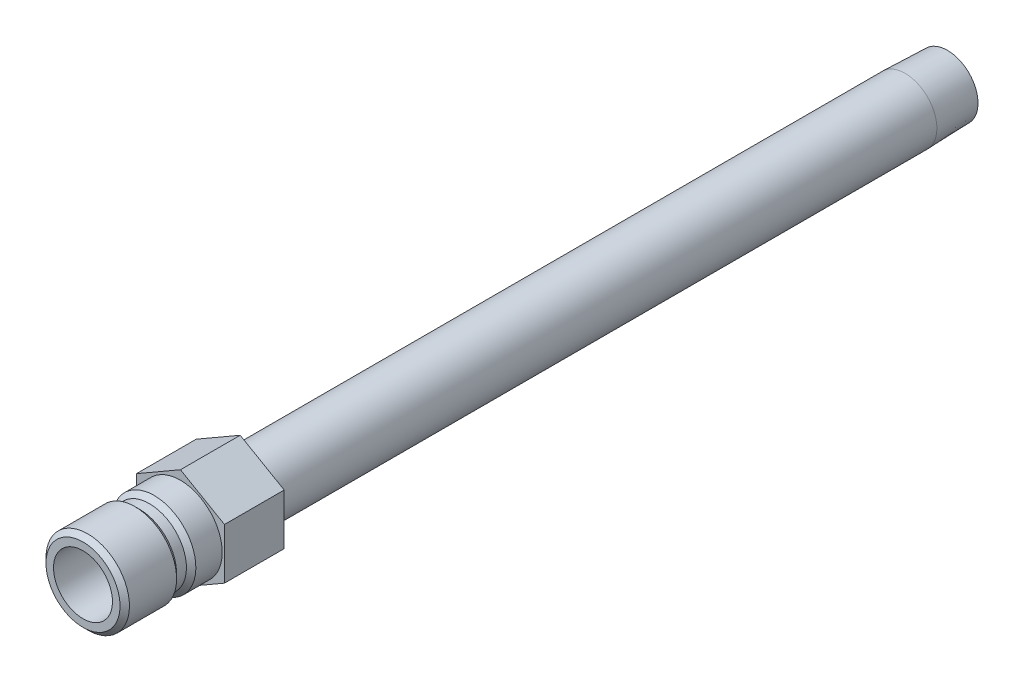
ISO-10303-21;
HEADER;
FILE_DESCRIPTION(('STEP AP214'),'2;1');
FILE_NAME('part.step','',(''),(''),'','','');
FILE_SCHEMA(('AUTOMOTIVE_DESIGN { 1 0 10303 214 1 1 1 1 }'));
ENDSEC;
DATA;
#1=APPLICATION_CONTEXT('core data for automotive mechanical design processes');
#2=APPLICATION_PROTOCOL_DEFINITION('international standard','automotive_design',2000,#1);
#3=PRODUCT_CONTEXT('',#1,'mechanical');
#4=PRODUCT('Part','Part','',(#3));
#5=PRODUCT_RELATED_PRODUCT_CATEGORY('part','',(#4));
#6=PRODUCT_DEFINITION_FORMATION('','',#4);
#7=PRODUCT_DEFINITION_CONTEXT('part definition',#1,'design');
#8=PRODUCT_DEFINITION('design','',#6,#7);
#9=PRODUCT_DEFINITION_SHAPE('','',#8);
#10=(LENGTH_UNIT() NAMED_UNIT(*) SI_UNIT(.MILLI.,.METRE.));
#11=(NAMED_UNIT(*) PLANE_ANGLE_UNIT() SI_UNIT($,.RADIAN.));
#12=(NAMED_UNIT(*) SI_UNIT($,.STERADIAN.) SOLID_ANGLE_UNIT());
#13=UNCERTAINTY_MEASURE_WITH_UNIT(LENGTH_MEASURE(1.E-05),#10,'distance_accuracy_value','');
#14=(GEOMETRIC_REPRESENTATION_CONTEXT(3) GLOBAL_UNCERTAINTY_ASSIGNED_CONTEXT((#13)) GLOBAL_UNIT_ASSIGNED_CONTEXT((#10,
#11,#12)) REPRESENTATION_CONTEXT('',''));
#15=CARTESIAN_POINT('',(0.,0.,0.));
#16=DIRECTION('',(0.,0.,1.));
#17=DIRECTION('',(1.,0.,0.));
#18=AXIS2_PLACEMENT_3D('',#15,#16,#17);
#19=CARTESIAN_POINT('',(0.,0.,-9.652));
#20=DIRECTION('',(0.,0.,-1.));
#21=DIRECTION('',(0.,1.,0.));
#22=AXIS2_PLACEMENT_3D('',#19,#20,#21);
#23=CYLINDRICAL_SURFACE('',#22,4.7625);
#24=CARTESIAN_POINT('',(0.,0.,3.556));
#25=DIRECTION('',(0.,0.,-1.));
#26=DIRECTION('',(0.,1.,0.));
#27=AXIS2_PLACEMENT_3D('',#24,#25,#26);
#28=CIRCLE('',#27,4.7625);
#29=CARTESIAN_POINT('',(0.,4.7625,3.556));
#30=VERTEX_POINT('',#29);
#31=EDGE_CURVE('E137',#30,#30,#28,.T.);
#32=ORIENTED_EDGE('',*,*,#31,.T.);
#33=EDGE_LOOP('',(#32));
#34=FACE_BOUND('',#33,.T.);
#35=CARTESIAN_POINT('',(0.,0.,15.748));
#36=DIRECTION('',(0.,0.,-1.));
#37=DIRECTION('',(0.,1.,0.));
#38=AXIS2_PLACEMENT_3D('',#35,#36,#37);
#39=CIRCLE('',#38,4.7625);
#40=CARTESIAN_POINT('',(0.,4.7625,15.748));
#41=VERTEX_POINT('',#40);
#42=EDGE_CURVE('E41',#41,#41,#39,.T.);
#43=ORIENTED_EDGE('',*,*,#42,.F.);
#44=EDGE_LOOP('',(#43));
#45=FACE_BOUND('',#44,.T.);
#46=ADVANCED_FACE('F33',(#34,#45),#23,.F.);
#47=CARTESIAN_POINT('',(0.,4.7625,15.748));
#48=DIRECTION('',(0.,0.,1.));
#49=DIRECTION('',(0.,-1.,0.));
#50=AXIS2_PLACEMENT_3D('',#47,#48,#49);
#51=PLANE('',#50);
#52=ORIENTED_EDGE('',*,*,#42,.T.);
#53=EDGE_LOOP('',(#52));
#54=FACE_BOUND('',#53,.T.);
#55=CARTESIAN_POINT('',(0.,0.,15.748));
#56=DIRECTION('',(0.,0.,-1.));
#57=DIRECTION('',(0.,1.,0.));
#58=AXIS2_PLACEMENT_3D('',#55,#56,#57);
#59=CIRCLE('',#58,5.9817);
#60=CARTESIAN_POINT('',(0.,5.9817,15.748));
#61=VERTEX_POINT('',#60);
#62=EDGE_CURVE('E175',#61,#61,#59,.T.);
#63=ORIENTED_EDGE('',*,*,#62,.F.);
#64=EDGE_LOOP('',(#63));
#65=FACE_BOUND('',#64,.T.);
#66=ADVANCED_FACE('F180',(#54,#65),#51,.T.);
#67=CARTESIAN_POINT('',(0.,0.,14.986));
#68=DIRECTION('',(0.,0.,-1.));
#69=DIRECTION('',(0.,1.,0.));
#70=AXIS2_PLACEMENT_3D('',#67,#68,#69);
#71=CONICAL_SURFACE('',#70,6.7437,0.785398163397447);
#72=ORIENTED_EDGE('',*,*,#62,.T.);
#73=EDGE_LOOP('',(#72));
#74=FACE_BOUND('',#73,.T.);
#75=CARTESIAN_POINT('',(0.,0.,14.986));
#76=DIRECTION('',(0.,0.,-1.));
#77=DIRECTION('',(0.,1.,0.));
#78=AXIS2_PLACEMENT_3D('',#75,#76,#77);
#79=CIRCLE('',#78,6.7437);
#80=CARTESIAN_POINT('',(0.,6.7437,14.986));
#81=VERTEX_POINT('',#80);
#82=EDGE_CURVE('E172',#81,#81,#79,.T.);
#83=ORIENTED_EDGE('',*,*,#82,.F.);
#84=EDGE_LOOP('',(#83));
#85=FACE_BOUND('',#84,.T.);
#86=ADVANCED_FACE('F188',(#74,#85),#71,.T.);
#87=CARTESIAN_POINT('',(0.,0.,-9.652));
#88=DIRECTION('',(0.,0.,-1.));
#89=DIRECTION('',(0.,1.,0.));
#90=AXIS2_PLACEMENT_3D('',#87,#88,#89);
#91=CYLINDRICAL_SURFACE('',#90,6.7437);
#92=ORIENTED_EDGE('',*,*,#82,.T.);
#93=EDGE_LOOP('',(#92));
#94=FACE_BOUND('',#93,.T.);
#95=CARTESIAN_POINT('',(0.,0.,7.366));
#96=DIRECTION('',(0.,0.,-1.));
#97=DIRECTION('',(0.,1.,0.));
#98=AXIS2_PLACEMENT_3D('',#95,#96,#97);
#99=CIRCLE('',#98,6.7437);
#100=CARTESIAN_POINT('',(0.,6.7437,7.366));
#101=VERTEX_POINT('',#100);
#102=EDGE_CURVE('E169',#101,#101,#99,.T.);
#103=ORIENTED_EDGE('',*,*,#102,.F.);
#104=EDGE_LOOP('',(#103));
#105=FACE_BOUND('',#104,.T.);
#106=ADVANCED_FACE('F237',(#94,#105),#91,.T.);
#107=CARTESIAN_POINT('',(0.,0.,6.604));
#108=DIRECTION('',(0.,0.,1.));
#109=DIRECTION('',(0.,-1.,0.));
#110=AXIS2_PLACEMENT_3D('',#107,#108,#109);
#111=CONICAL_SURFACE('',#110,5.9817,0.785398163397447);
#112=ORIENTED_EDGE('',*,*,#102,.T.);
#113=EDGE_LOOP('',(#112));
#114=FACE_BOUND('',#113,.T.);
#115=CARTESIAN_POINT('',(0.,0.,6.604));
#116=DIRECTION('',(0.,0.,-1.));
#117=DIRECTION('',(0.,1.,0.));
#118=AXIS2_PLACEMENT_3D('',#115,#116,#117);
#119=CIRCLE('',#118,5.9817);
#120=CARTESIAN_POINT('',(0.,5.9817,6.604));
#121=VERTEX_POINT('',#120);
#122=EDGE_CURVE('E166',#121,#121,#119,.T.);
#123=ORIENTED_EDGE('',*,*,#122,.F.);
#124=EDGE_LOOP('',(#123));
#125=FACE_BOUND('',#124,.T.);
#126=ADVANCED_FACE('F233',(#114,#125),#111,.T.);
#127=CARTESIAN_POINT('',(0.,0.,-9.652));
#128=DIRECTION('',(0.,0.,-1.));
#129=DIRECTION('',(0.,1.,0.));
#130=AXIS2_PLACEMENT_3D('',#127,#128,#129);
#131=CYLINDRICAL_SURFACE('',#130,5.9817);
#132=ORIENTED_EDGE('',*,*,#122,.T.);
#133=EDGE_LOOP('',(#132));
#134=FACE_BOUND('',#133,.T.);
#135=CARTESIAN_POINT('',(0.,0.,5.0165));
#136=DIRECTION('',(0.,0.,-1.));
#137=DIRECTION('',(0.,1.,0.));
#138=AXIS2_PLACEMENT_3D('',#135,#136,#137);
#139=CIRCLE('',#138,5.9817);
#140=CARTESIAN_POINT('',(0.,5.9817,5.0165));
#141=VERTEX_POINT('',#140);
#142=EDGE_CURVE('E163',#141,#141,#139,.T.);
#143=ORIENTED_EDGE('',*,*,#142,.F.);
#144=EDGE_LOOP('',(#143));
#145=FACE_BOUND('',#144,.T.);
#146=ADVANCED_FACE('F229',(#134,#145),#131,.T.);
#147=CARTESIAN_POINT('',(0.,0.,4.2545));
#148=DIRECTION('',(0.,0.,-1.));
#149=DIRECTION('',(0.,1.,0.));
#150=AXIS2_PLACEMENT_3D('',#147,#148,#149);
#151=CONICAL_SURFACE('',#150,6.7437,0.785398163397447);
#152=ORIENTED_EDGE('',*,*,#142,.T.);
#153=EDGE_LOOP('',(#152));
#154=FACE_BOUND('',#153,.T.);
#155=CARTESIAN_POINT('',(0.,0.,4.2545));
#156=DIRECTION('',(0.,0.,-1.));
#157=DIRECTION('',(0.,1.,0.));
#158=AXIS2_PLACEMENT_3D('',#155,#156,#157);
#159=CIRCLE('',#158,6.7437);
#160=CARTESIAN_POINT('',(0.,6.7437,4.2545));
#161=VERTEX_POINT('',#160);
#162=EDGE_CURVE('E160',#161,#161,#159,.T.);
#163=ORIENTED_EDGE('',*,*,#162,.F.);
#164=EDGE_LOOP('',(#163));
#165=FACE_BOUND('',#164,.T.);
#166=ADVANCED_FACE('F225',(#154,#165),#151,.T.);
#167=CARTESIAN_POINT('',(0.,0.,-9.652));
#168=DIRECTION('',(0.,0.,-1.));
#169=DIRECTION('',(0.,1.,0.));
#170=AXIS2_PLACEMENT_3D('',#167,#168,#169);
#171=CYLINDRICAL_SURFACE('',#170,6.7437);
#172=CARTESIAN_POINT('',(0.,0.,0.));
#173=DIRECTION('',(0.,0.,1.));
#174=DIRECTION('',(1.,0.,0.));
#175=AXIS2_PLACEMENT_3D('',#172,#173,#174);
#176=CIRCLE('',#175,6.7437);
#177=CARTESIAN_POINT('',(6.7437,0.,0.));
#178=VERTEX_POINT('',#177);
#179=EDGE_CURVE('E11',#178,#178,#176,.F.);
#180=ORIENTED_EDGE('',*,*,#179,.F.);
#181=EDGE_LOOP('',(#180));
#182=FACE_BOUND('',#181,.T.);
#183=ORIENTED_EDGE('',*,*,#162,.T.);
#184=EDGE_LOOP('',(#183));
#185=FACE_BOUND('',#184,.T.);
#186=ADVANCED_FACE('F221',(#182,#185),#171,.T.);
#187=CARTESIAN_POINT('',(0.,6.7437,-9.652));
#188=DIRECTION('',(0.,0.,-1.));
#189=DIRECTION('',(0.,1.,0.));
#190=AXIS2_PLACEMENT_3D('',#187,#188,#189);
#191=PLANE('',#190);
#192=CARTESIAN_POINT('',(0.,0.,-9.652));
#193=DIRECTION('',(0.,0.,-1.));
#194=DIRECTION('',(0.,1.,0.));
#195=AXIS2_PLACEMENT_3D('',#192,#193,#194);
#196=CIRCLE('',#195,5.1435);
#197=CARTESIAN_POINT('',(0.,5.1435,-9.652));
#198=VERTEX_POINT('',#197);
#199=EDGE_CURVE('E157',#198,#198,#196,.T.);
#200=ORIENTED_EDGE('',*,*,#199,.F.);
#201=EDGE_LOOP('',(#200));
#202=FACE_BOUND('',#201,.T.);
#203=DIRECTION('',(-0.866025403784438,-0.5,0.));
#204=VECTOR('',#203,1.);
#205=CARTESIAN_POINT('',(0.,8.21223022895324,-9.652));
#206=LINE('',#205,#204);
#207=CARTESIAN_POINT('',(0.,8.21223022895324,-9.652));
#208=VERTEX_POINT('',#207);
#209=CARTESIAN_POINT('',(-7.112,4.10611511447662,-9.652));
#210=VERTEX_POINT('',#209);
#211=EDGE_CURVE('E135',#208,#210,#206,.T.);
#212=ORIENTED_EDGE('',*,*,#211,.F.);
#213=DIRECTION('',(-0.866025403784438,0.5,0.));
#214=VECTOR('',#213,1.);
#215=CARTESIAN_POINT('',(7.112,4.10611511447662,-9.652));
#216=LINE('',#215,#214);
#217=CARTESIAN_POINT('',(7.112,4.10611511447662,-9.652));
#218=VERTEX_POINT('',#217);
#219=EDGE_CURVE('E110',#218,#208,#216,.T.);
#220=ORIENTED_EDGE('',*,*,#219,.F.);
#221=DIRECTION('',(0.,1.,0.));
#222=VECTOR('',#221,1.);
#223=CARTESIAN_POINT('',(7.112,-4.10611511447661,-9.652));
#224=LINE('',#223,#222);
#225=CARTESIAN_POINT('',(7.112,-4.10611511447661,-9.652));
#226=VERTEX_POINT('',#225);
#227=EDGE_CURVE('E95',#226,#218,#224,.T.);
#228=ORIENTED_EDGE('',*,*,#227,.F.);
#229=DIRECTION('',(0.866025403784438,0.5,0.));
#230=VECTOR('',#229,1.);
#231=CARTESIAN_POINT('',(0.,-8.21223022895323,-9.652));
#232=LINE('',#231,#230);
#233=CARTESIAN_POINT('',(0.,-8.21223022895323,-9.652));
#234=VERTEX_POINT('',#233);
#235=EDGE_CURVE('E108',#234,#226,#232,.T.);
#236=ORIENTED_EDGE('',*,*,#235,.F.);
#237=DIRECTION('',(0.866025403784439,-0.5,0.));
#238=VECTOR('',#237,1.);
#239=CARTESIAN_POINT('',(-7.112,-4.10611511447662,-9.652));
#240=LINE('',#239,#238);
#241=CARTESIAN_POINT('',(-7.112,-4.10611511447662,-9.652));
#242=VERTEX_POINT('',#241);
#243=EDGE_CURVE('E113',#242,#234,#240,.T.);
#244=ORIENTED_EDGE('',*,*,#243,.F.);
#245=DIRECTION('',(0.,-1.,0.));
#246=VECTOR('',#245,1.);
#247=CARTESIAN_POINT('',(-7.112,4.10611511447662,-9.652));
#248=LINE('',#247,#246);
#249=EDGE_CURVE('E115',#210,#242,#248,.T.);
#250=ORIENTED_EDGE('',*,*,#249,.F.);
#251=EDGE_LOOP('',(#212,#220,#228,#236,#244,#250));
#252=FACE_BOUND('',#251,.T.);
#253=ADVANCED_FACE('F106',(#202,#252),#191,.T.);
#254=CARTESIAN_POINT('',(0.,0.,-9.652));
#255=DIRECTION('',(0.,0.,-1.));
#256=DIRECTION('',(0.,1.,0.));
#257=AXIS2_PLACEMENT_3D('',#254,#255,#256);
#258=CYLINDRICAL_SURFACE('',#257,5.1435);
#259=ORIENTED_EDGE('',*,*,#199,.T.);
#260=EDGE_LOOP('',(#259));
#261=FACE_BOUND('',#260,.T.);
#262=CARTESIAN_POINT('',(0.,0.,-117.094));
#263=DIRECTION('',(0.,0.,-1.));
#264=DIRECTION('',(0.,1.,0.));
#265=AXIS2_PLACEMENT_3D('',#262,#263,#264);
#266=CIRCLE('',#265,5.14349999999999);
#267=CARTESIAN_POINT('',(0.,5.1435,-117.094));
#268=VERTEX_POINT('',#267);
#269=EDGE_CURVE('E154',#268,#268,#266,.T.);
#270=ORIENTED_EDGE('',*,*,#269,.F.);
#271=EDGE_LOOP('',(#270));
#272=FACE_BOUND('',#271,.T.);
#273=ADVANCED_FACE('F214',(#261,#272),#258,.T.);
#274=CARTESIAN_POINT('',(0.,0.,-123.952));
#275=DIRECTION('',(0.,0.,1.));
#276=DIRECTION('',(0.,-1.,0.));
#277=AXIS2_PLACEMENT_3D('',#274,#275,#276);
#278=CONICAL_SURFACE('',#277,4.9291887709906,0.0312396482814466);
#279=ORIENTED_EDGE('',*,*,#269,.T.);
#280=EDGE_LOOP('',(#279));
#281=FACE_BOUND('',#280,.T.);
#282=CARTESIAN_POINT('',(0.,0.,-123.952));
#283=DIRECTION('',(0.,0.,-1.));
#284=DIRECTION('',(0.,1.,0.));
#285=AXIS2_PLACEMENT_3D('',#282,#283,#284);
#286=CIRCLE('',#285,4.9291887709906);
#287=CARTESIAN_POINT('',(0.,4.9291887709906,-123.952));
#288=VERTEX_POINT('',#287);
#289=EDGE_CURVE('E151',#288,#288,#286,.T.);
#290=ORIENTED_EDGE('',*,*,#289,.F.);
#291=EDGE_LOOP('',(#290));
#292=FACE_BOUND('',#291,.T.);
#293=ADVANCED_FACE('F210',(#281,#292),#278,.T.);
#294=CARTESIAN_POINT('',(0.,4.9291887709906,-123.952));
#295=DIRECTION('',(0.,0.,-1.));
#296=DIRECTION('',(0.,1.,0.));
#297=AXIS2_PLACEMENT_3D('',#294,#295,#296);
#298=PLANE('',#297);
#299=ORIENTED_EDGE('',*,*,#289,.T.);
#300=EDGE_LOOP('',(#299));
#301=FACE_BOUND('',#300,.T.);
#302=CARTESIAN_POINT('',(0.,0.,-123.952));
#303=DIRECTION('',(0.,0.,-1.));
#304=DIRECTION('',(0.,1.,0.));
#305=AXIS2_PLACEMENT_3D('',#302,#303,#304);
#306=CIRCLE('',#305,3.41629999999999);
#307=CARTESIAN_POINT('',(0.,3.4163,-123.952));
#308=VERTEX_POINT('',#307);
#309=EDGE_CURVE('E148',#308,#308,#306,.T.);
#310=ORIENTED_EDGE('',*,*,#309,.F.);
#311=EDGE_LOOP('',(#310));
#312=FACE_BOUND('',#311,.T.);
#313=ADVANCED_FACE('F203',(#301,#312),#298,.T.);
#314=CARTESIAN_POINT('',(0.,0.,-9.652));
#315=DIRECTION('',(0.,0.,-1.));
#316=DIRECTION('',(0.,1.,0.));
#317=AXIS2_PLACEMENT_3D('',#314,#315,#316);
#318=CYLINDRICAL_SURFACE('',#317,3.41629999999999);
#319=ORIENTED_EDGE('',*,*,#309,.T.);
#320=EDGE_LOOP('',(#319));
#321=FACE_BOUND('',#320,.T.);
#322=CARTESIAN_POINT('',(0.,0.,2.84021276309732));
#323=DIRECTION('',(0.,0.,-1.));
#324=DIRECTION('',(0.,1.,0.));
#325=AXIS2_PLACEMENT_3D('',#322,#323,#324);
#326=CIRCLE('',#325,3.4163);
#327=CARTESIAN_POINT('',(0.,3.4163,2.84021276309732));
#328=VERTEX_POINT('',#327);
#329=EDGE_CURVE('E145',#328,#328,#326,.T.);
#330=ORIENTED_EDGE('',*,*,#329,.F.);
#331=EDGE_LOOP('',(#330));
#332=FACE_BOUND('',#331,.T.);
#333=ADVANCED_FACE('F194',(#321,#332),#318,.F.);
#334=CARTESIAN_POINT('',(0.,0.,3.556));
#335=DIRECTION('',(0.,0.,1.));
#336=DIRECTION('',(0.,-1.,0.));
#337=AXIS2_PLACEMENT_3D('',#334,#335,#336);
#338=CONICAL_SURFACE('',#337,4.7625,1.08210413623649);
#339=ORIENTED_EDGE('',*,*,#329,.T.);
#340=EDGE_LOOP('',(#339));
#341=FACE_BOUND('',#340,.T.);
#342=ORIENTED_EDGE('',*,*,#31,.F.);
#343=EDGE_LOOP('',(#342));
#344=FACE_BOUND('',#343,.T.);
#345=ADVANCED_FACE('F191',(#341,#344),#338,.F.);
#346=CARTESIAN_POINT('',(0.,8.21223022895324,-9.652));
#347=DIRECTION('',(-0.5,0.866025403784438,0.));
#348=DIRECTION('',(-0.866025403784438,-0.5,0.));
#349=AXIS2_PLACEMENT_3D('',#346,#347,#348);
#350=PLANE('',#349);
#351=DIRECTION('',(-0.866025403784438,-0.5,0.));
#352=VECTOR('',#351,1.);
#353=CARTESIAN_POINT('',(0.,8.21223022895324,0.));
#354=LINE('',#353,#352);
#355=CARTESIAN_POINT('',(0.,8.21223022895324,0.));
#356=VERTEX_POINT('',#355);
#357=CARTESIAN_POINT('',(-7.112,4.10611511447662,0.));
#358=VERTEX_POINT('',#357);
#359=EDGE_CURVE('E120',#356,#358,#354,.T.);
#360=ORIENTED_EDGE('',*,*,#359,.F.);
#361=DIRECTION('',(0.,0.,1.));
#362=VECTOR('',#361,1.);
#363=CARTESIAN_POINT('',(0.,8.21223022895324,-9.652));
#364=LINE('',#363,#362);
#365=EDGE_CURVE('E49',#208,#356,#364,.T.);
#366=ORIENTED_EDGE('',*,*,#365,.F.);
#367=ORIENTED_EDGE('',*,*,#211,.T.);
#368=DIRECTION('',(0.,0.,1.));
#369=VECTOR('',#368,1.);
#370=CARTESIAN_POINT('',(-7.112,4.10611511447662,-9.652));
#371=LINE('',#370,#369);
#372=EDGE_CURVE('E84',#210,#358,#371,.T.);
#373=ORIENTED_EDGE('',*,*,#372,.T.);
#374=EDGE_LOOP('',(#360,#366,#367,#373));
#375=FACE_BOUND('',#374,.T.);
#376=ADVANCED_FACE('F193',(#375),#350,.T.);
#377=CARTESIAN_POINT('',(7.112,4.10611511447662,-9.652));
#378=DIRECTION('',(0.5,0.866025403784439,0.));
#379=DIRECTION('',(-0.866025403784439,0.5,0.));
#380=AXIS2_PLACEMENT_3D('',#377,#378,#379);
#381=PLANE('',#380);
#382=DIRECTION('',(-0.866025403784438,0.5,0.));
#383=VECTOR('',#382,1.);
#384=CARTESIAN_POINT('',(7.112,4.10611511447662,0.));
#385=LINE('',#384,#383);
#386=CARTESIAN_POINT('',(7.112,4.10611511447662,0.));
#387=VERTEX_POINT('',#386);
#388=EDGE_CURVE('E132',#387,#356,#385,.T.);
#389=ORIENTED_EDGE('',*,*,#388,.F.);
#390=DIRECTION('',(0.,0.,1.));
#391=VECTOR('',#390,1.);
#392=CARTESIAN_POINT('',(7.112,4.10611511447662,-9.652));
#393=LINE('',#392,#391);
#394=EDGE_CURVE('E72',#218,#387,#393,.T.);
#395=ORIENTED_EDGE('',*,*,#394,.F.);
#396=ORIENTED_EDGE('',*,*,#219,.T.);
#397=ORIENTED_EDGE('',*,*,#365,.T.);
#398=EDGE_LOOP('',(#389,#395,#396,#397));
#399=FACE_BOUND('',#398,.T.);
#400=ADVANCED_FACE('F201',(#399),#381,.T.);
#401=CARTESIAN_POINT('',(7.112,-4.10611511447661,-9.652));
#402=DIRECTION('',(1.,0.,0.));
#403=DIRECTION('',(0.,1.,0.));
#404=AXIS2_PLACEMENT_3D('',#401,#402,#403);
#405=PLANE('',#404);
#406=DIRECTION('',(0.,1.,0.));
#407=VECTOR('',#406,1.);
#408=CARTESIAN_POINT('',(7.112,-4.10611511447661,0.));
#409=LINE('',#408,#407);
#410=CARTESIAN_POINT('',(7.112,-4.10611511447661,0.));
#411=VERTEX_POINT('',#410);
#412=EDGE_CURVE('E97',#411,#387,#409,.T.);
#413=ORIENTED_EDGE('',*,*,#412,.F.);
#414=DIRECTION('',(0.,0.,1.));
#415=VECTOR('',#414,1.);
#416=CARTESIAN_POINT('',(7.112,-4.10611511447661,-9.652));
#417=LINE('',#416,#415);
#418=EDGE_CURVE('E92',#226,#411,#417,.T.);
#419=ORIENTED_EDGE('',*,*,#418,.F.);
#420=ORIENTED_EDGE('',*,*,#227,.T.);
#421=ORIENTED_EDGE('',*,*,#394,.T.);
#422=EDGE_LOOP('',(#413,#419,#420,#421));
#423=FACE_BOUND('',#422,.T.);
#424=ADVANCED_FACE('F94',(#423),#405,.T.);
#425=CARTESIAN_POINT('',(0.,-8.21223022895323,-9.652));
#426=DIRECTION('',(0.5,-0.866025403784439,0.));
#427=DIRECTION('',(0.866025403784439,0.5,0.));
#428=AXIS2_PLACEMENT_3D('',#425,#426,#427);
#429=PLANE('',#428);
#430=DIRECTION('',(0.866025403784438,0.5,0.));
#431=VECTOR('',#430,1.);
#432=CARTESIAN_POINT('',(0.,-8.21223022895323,0.));
#433=LINE('',#432,#431);
#434=CARTESIAN_POINT('',(0.,-8.21223022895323,0.));
#435=VERTEX_POINT('',#434);
#436=EDGE_CURVE('E129',#435,#411,#433,.T.);
#437=ORIENTED_EDGE('',*,*,#436,.F.);
#438=DIRECTION('',(0.,0.,1.));
#439=VECTOR('',#438,1.);
#440=CARTESIAN_POINT('',(0.,-8.21223022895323,-9.652));
#441=LINE('',#440,#439);
#442=EDGE_CURVE('E102',#234,#435,#441,.T.);
#443=ORIENTED_EDGE('',*,*,#442,.F.);
#444=ORIENTED_EDGE('',*,*,#235,.T.);
#445=ORIENTED_EDGE('',*,*,#418,.T.);
#446=EDGE_LOOP('',(#437,#443,#444,#445));
#447=FACE_BOUND('',#446,.T.);
#448=ADVANCED_FACE('F112',(#447),#429,.T.);
#449=CARTESIAN_POINT('',(-7.112,-4.10611511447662,-9.652));
#450=DIRECTION('',(-0.5,-0.866025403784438,0.));
#451=DIRECTION('',(0.866025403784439,-0.5,0.));
#452=AXIS2_PLACEMENT_3D('',#449,#450,#451);
#453=PLANE('',#452);
#454=DIRECTION('',(0.866025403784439,-0.5,0.));
#455=VECTOR('',#454,1.);
#456=CARTESIAN_POINT('',(-7.112,-4.10611511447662,0.));
#457=LINE('',#456,#455);
#458=CARTESIAN_POINT('',(-7.112,-4.10611511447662,0.));
#459=VERTEX_POINT('',#458);
#460=EDGE_CURVE('E126',#459,#435,#457,.T.);
#461=ORIENTED_EDGE('',*,*,#460,.F.);
#462=DIRECTION('',(0.,0.,1.));
#463=VECTOR('',#462,1.);
#464=CARTESIAN_POINT('',(-7.112,-4.10611511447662,-9.652));
#465=LINE('',#464,#463);
#466=EDGE_CURVE('E140',#242,#459,#465,.T.);
#467=ORIENTED_EDGE('',*,*,#466,.F.);
#468=ORIENTED_EDGE('',*,*,#243,.T.);
#469=ORIENTED_EDGE('',*,*,#442,.T.);
#470=EDGE_LOOP('',(#461,#467,#468,#469));
#471=FACE_BOUND('',#470,.T.);
#472=ADVANCED_FACE('F338',(#471),#453,.T.);
#473=CARTESIAN_POINT('',(-7.112,4.10611511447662,-9.652));
#474=DIRECTION('',(-1.,0.,0.));
#475=DIRECTION('',(0.,-1.,0.));
#476=AXIS2_PLACEMENT_3D('',#473,#474,#475);
#477=PLANE('',#476);
#478=DIRECTION('',(0.,-1.,0.));
#479=VECTOR('',#478,1.);
#480=CARTESIAN_POINT('',(-7.112,4.10611511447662,0.));
#481=LINE('',#480,#479);
#482=EDGE_CURVE('E123',#358,#459,#481,.T.);
#483=ORIENTED_EDGE('',*,*,#482,.F.);
#484=ORIENTED_EDGE('',*,*,#372,.F.);
#485=ORIENTED_EDGE('',*,*,#249,.T.);
#486=ORIENTED_EDGE('',*,*,#466,.T.);
#487=EDGE_LOOP('',(#483,#484,#485,#486));
#488=FACE_BOUND('',#487,.T.);
#489=ADVANCED_FACE('F346',(#488),#477,.T.);
#490=CARTESIAN_POINT('',(-7.112,4.10611511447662,0.));
#491=DIRECTION('',(0.,0.,1.));
#492=DIRECTION('',(1.,0.,0.));
#493=AXIS2_PLACEMENT_3D('',#490,#491,#492);
#494=PLANE('',#493);
#495=ORIENTED_EDGE('',*,*,#179,.T.);
#496=EDGE_LOOP('',(#495));
#497=FACE_BOUND('',#496,.T.);
#498=ORIENTED_EDGE('',*,*,#359,.T.);
#499=ORIENTED_EDGE('',*,*,#482,.T.);
#500=ORIENTED_EDGE('',*,*,#460,.T.);
#501=ORIENTED_EDGE('',*,*,#436,.T.);
#502=ORIENTED_EDGE('',*,*,#412,.T.);
#503=ORIENTED_EDGE('',*,*,#388,.T.);
#504=EDGE_LOOP('',(#498,#499,#500,#501,#502,#503));
#505=FACE_BOUND('',#504,.T.);
#506=ADVANCED_FACE('F355',(#497,#505),#494,.T.);
#507=CLOSED_SHELL('',(#46,#66,#86,#106,#126,#146,#166,#186,#253,#273,#293,#313,#333,#345,#376,
#400,#424,#448,#472,#489,#506));
#508=MANIFOLD_SOLID_BREP('B2',#507);
#509=ADVANCED_BREP_SHAPE_REPRESENTATION('',(#18,#508),#14);
#510=SHAPE_DEFINITION_REPRESENTATION(#9,#509);
ENDSEC;
END-ISO-10303-21;
